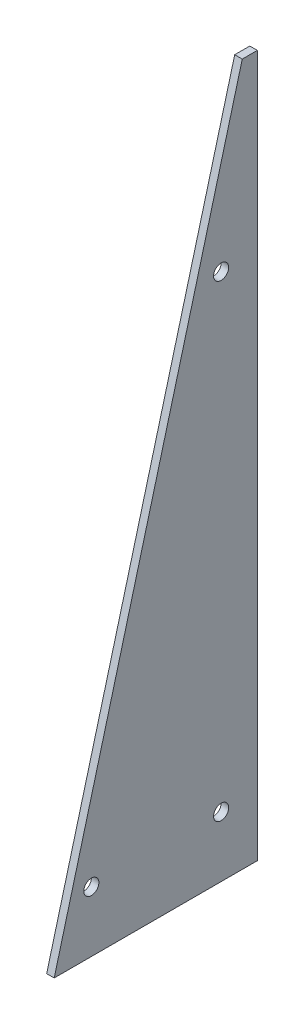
from build123d import *

# Parameters (mm, degrees)
BOSS_EXTRUDE1_DEPTH        = 6.35
F_1_2_0_5_DIAMETER_HOLE1_D = 12.7
F_4_40_TAPPED_HOLE1_D      = 2.2606
F_4_40_TAPPED_HOLE1_DEPTH  = 7.5946
F_4_40_TAPPED_HOLE1_TIP    = 0.679152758
F_6_32_TAPPED_HOLE1_D      = 2.7051
F_6_32_TAPPED_HOLE1_DEPTH  = 9.398
F_6_32_TAPPED_HOLE1_TIP    = 0.81269403


with BuildPart() as part:
    # Sketch1 → Boss-Extrude1 (new body)
    with BuildSketch(Plane(origin=(0, 0, 0), x_dir=(0, 0, -1), z_dir=(1, 0, 0))):
        Polygon((0, 0), (0, 590.55), (-12.7, 590.55), (-170.93739559, 0), align=None)
    extrude(amount=BOSS_EXTRUDE1_DEPTH)

    # 1_2 _0.5_ Diameter Hole1 (through all)
    with Locations(Plane(origin=(6.35, 0, 0), x_dir=(0, 0, -1), z_dir=(1, 0, 0))):
        with Locations((-139.7, 50.8), (-30.48, 50.8), (-30.48, 444.5)):
            Hole(F_1_2_0_5_DIAMETER_HOLE1_D / 2)

    # 4-40 Tapped Hole1
    with Locations(Plane(origin=(0, 0, 0), x_dir=(-1, 0, 0), z_dir=(0, 0, -1))):
        with Locations((-3.175, 571.5), (-3.175, 462.28), (-3.175, 353.06), (-3.175, 243.84), (-3.175, 134.62), (-3.175, 25.4)):
            Hole(F_4_40_TAPPED_HOLE1_D / 2, depth=F_4_40_TAPPED_HOLE1_DEPTH)
            with Locations((0, 0, -(F_4_40_TAPPED_HOLE1_DEPTH + F_4_40_TAPPED_HOLE1_TIP / 2))):  # 118° drill point
                Cone(0, F_4_40_TAPPED_HOLE1_D / 2, F_4_40_TAPPED_HOLE1_TIP, mode=Mode.SUBTRACT)

    # 6-32 Tapped Hole1
    with Locations(Plane(origin=(0, 0, 0), x_dir=(-1, 0, 0), z_dir=(0, -1, 0))):
        with Locations((-3.175, -12.7), (-3.175, -85.725), (-3.175, -158.75)):
            Hole(F_6_32_TAPPED_HOLE1_D / 2, depth=F_6_32_TAPPED_HOLE1_DEPTH)
            with Locations((0, 0, -(F_6_32_TAPPED_HOLE1_DEPTH + F_6_32_TAPPED_HOLE1_TIP / 2))):  # 118° drill point
                Cone(0, F_6_32_TAPPED_HOLE1_D / 2, F_6_32_TAPPED_HOLE1_TIP, mode=Mode.SUBTRACT)


solid = part.part
